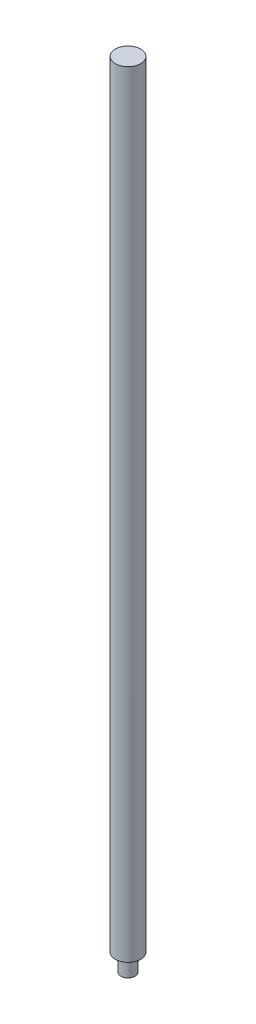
ISO-10303-21;
HEADER;
FILE_DESCRIPTION(('STEP AP214'),'2;1');
FILE_NAME('part.step','',(''),(''),'','','');
FILE_SCHEMA(('AUTOMOTIVE_DESIGN { 1 0 10303 214 1 1 1 1 }'));
ENDSEC;
DATA;
#1=APPLICATION_CONTEXT('core data for automotive mechanical design processes');
#2=APPLICATION_PROTOCOL_DEFINITION('international standard','automotive_design',2000,#1);
#3=PRODUCT_CONTEXT('',#1,'mechanical');
#4=PRODUCT('Part','Part','',(#3));
#5=PRODUCT_RELATED_PRODUCT_CATEGORY('part','',(#4));
#6=PRODUCT_DEFINITION_FORMATION('','',#4);
#7=PRODUCT_DEFINITION_CONTEXT('part definition',#1,'design');
#8=PRODUCT_DEFINITION('design','',#6,#7);
#9=PRODUCT_DEFINITION_SHAPE('','',#8);
#10=(LENGTH_UNIT() NAMED_UNIT(*) SI_UNIT(.MILLI.,.METRE.));
#11=(NAMED_UNIT(*) PLANE_ANGLE_UNIT() SI_UNIT($,.RADIAN.));
#12=(NAMED_UNIT(*) SI_UNIT($,.STERADIAN.) SOLID_ANGLE_UNIT());
#13=UNCERTAINTY_MEASURE_WITH_UNIT(LENGTH_MEASURE(1.E-05),#10,'distance_accuracy_value','');
#14=(GEOMETRIC_REPRESENTATION_CONTEXT(3) GLOBAL_UNCERTAINTY_ASSIGNED_CONTEXT((#13)) GLOBAL_UNIT_ASSIGNED_CONTEXT((#10,
#11,#12)) REPRESENTATION_CONTEXT('',''));
#15=CARTESIAN_POINT('',(0.,0.,0.));
#16=DIRECTION('',(0.,0.,1.));
#17=DIRECTION('',(1.,0.,0.));
#18=AXIS2_PLACEMENT_3D('',#15,#16,#17);
#19=CARTESIAN_POINT('',(0.,500.,0.));
#20=DIRECTION('',(0.,-1.,0.));
#21=DIRECTION('',(0.,0.,-1.));
#22=AXIS2_PLACEMENT_3D('',#19,#20,#21);
#23=CYLINDRICAL_SURFACE('',#22,8.);
#24=CARTESIAN_POINT('',(0.,500.,0.));
#25=DIRECTION('',(0.,1.,0.));
#26=DIRECTION('',(0.,0.,1.));
#27=AXIS2_PLACEMENT_3D('',#24,#25,#26);
#28=CIRCLE('',#27,8.);
#29=CARTESIAN_POINT('',(0.,500.,8.));
#30=VERTEX_POINT('',#29);
#31=EDGE_CURVE('E11',#30,#30,#28,.T.);
#32=ORIENTED_EDGE('',*,*,#31,.F.);
#33=EDGE_LOOP('',(#32));
#34=FACE_BOUND('',#33,.T.);
#35=CARTESIAN_POINT('',(0.,11.,0.));
#36=DIRECTION('',(0.,-1.,0.));
#37=DIRECTION('',(0.,0.,-1.));
#38=AXIS2_PLACEMENT_3D('',#35,#36,#37);
#39=CIRCLE('',#38,8.);
#40=CARTESIAN_POINT('',(0.,11.,-8.));
#41=VERTEX_POINT('',#40);
#42=EDGE_CURVE('E44',#41,#41,#39,.T.);
#43=ORIENTED_EDGE('',*,*,#42,.F.);
#44=EDGE_LOOP('',(#43));
#45=FACE_BOUND('',#44,.T.);
#46=ADVANCED_FACE('F45',(#34,#45),#23,.T.);
#47=CARTESIAN_POINT('',(0.,500.,0.));
#48=DIRECTION('',(0.,1.,0.));
#49=DIRECTION('',(0.,0.,1.));
#50=AXIS2_PLACEMENT_3D('',#47,#48,#49);
#51=PLANE('',#50);
#52=ORIENTED_EDGE('',*,*,#31,.T.);
#53=EDGE_LOOP('',(#52));
#54=FACE_BOUND('',#53,.T.);
#55=ADVANCED_FACE('F66',(#54),#51,.T.);
#56=CARTESIAN_POINT('',(0.,11.,0.));
#57=DIRECTION('',(0.,-1.,0.));
#58=DIRECTION('',(0.,0.,-1.));
#59=AXIS2_PLACEMENT_3D('',#56,#57,#58);
#60=PLANE('',#59);
#61=CARTESIAN_POINT('',(0.,11.,0.));
#62=DIRECTION('',(0.,-1.,0.));
#63=DIRECTION('',(0.,0.,-1.));
#64=AXIS2_PLACEMENT_3D('',#61,#62,#63);
#65=CIRCLE('',#64,4.5);
#66=CARTESIAN_POINT('',(0.,11.,-4.5));
#67=VERTEX_POINT('',#66);
#68=EDGE_CURVE('E55',#67,#67,#65,.T.);
#69=ORIENTED_EDGE('',*,*,#68,.F.);
#70=EDGE_LOOP('',(#69));
#71=FACE_BOUND('',#70,.T.);
#72=ORIENTED_EDGE('',*,*,#42,.T.);
#73=EDGE_LOOP('',(#72));
#74=FACE_BOUND('',#73,.T.);
#75=ADVANCED_FACE('F64',(#71,#74),#60,.T.);
#76=CARTESIAN_POINT('',(0.,11.,0.));
#77=DIRECTION('',(0.,-1.,0.));
#78=DIRECTION('',(0.,0.,-1.));
#79=AXIS2_PLACEMENT_3D('',#76,#77,#78);
#80=CYLINDRICAL_SURFACE('',#79,4.5);
#81=ORIENTED_EDGE('',*,*,#68,.T.);
#82=EDGE_LOOP('',(#81));
#83=FACE_BOUND('',#82,.T.);
#84=CARTESIAN_POINT('',(0.,0.,0.));
#85=DIRECTION('',(0.,-1.,0.));
#86=DIRECTION('',(0.,0.,-1.));
#87=AXIS2_PLACEMENT_3D('',#84,#85,#86);
#88=CIRCLE('',#87,4.5);
#89=CARTESIAN_POINT('',(0.,0.,-4.5));
#90=VERTEX_POINT('',#89);
#91=EDGE_CURVE('E53',#90,#90,#88,.T.);
#92=ORIENTED_EDGE('',*,*,#91,.F.);
#93=EDGE_LOOP('',(#92));
#94=FACE_BOUND('',#93,.T.);
#95=ADVANCED_FACE('F58',(#83,#94),#80,.T.);
#96=CARTESIAN_POINT('',(0.,0.,0.));
#97=DIRECTION('',(0.,1.,0.));
#98=DIRECTION('',(0.,0.,1.));
#99=AXIS2_PLACEMENT_3D('',#96,#97,#98);
#100=PLANE('',#99);
#101=ORIENTED_EDGE('',*,*,#91,.T.);
#102=EDGE_LOOP('',(#101));
#103=FACE_BOUND('',#102,.T.);
#104=ADVANCED_FACE('F79',(#103),#100,.F.);
#105=CLOSED_SHELL('',(#46,#55,#75,#95,#104));
#106=MANIFOLD_SOLID_BREP('B2',#105);
#107=ADVANCED_BREP_SHAPE_REPRESENTATION('',(#18,#106),#14);
#108=SHAPE_DEFINITION_REPRESENTATION(#9,#107);
ENDSEC;
END-ISO-10303-21;
